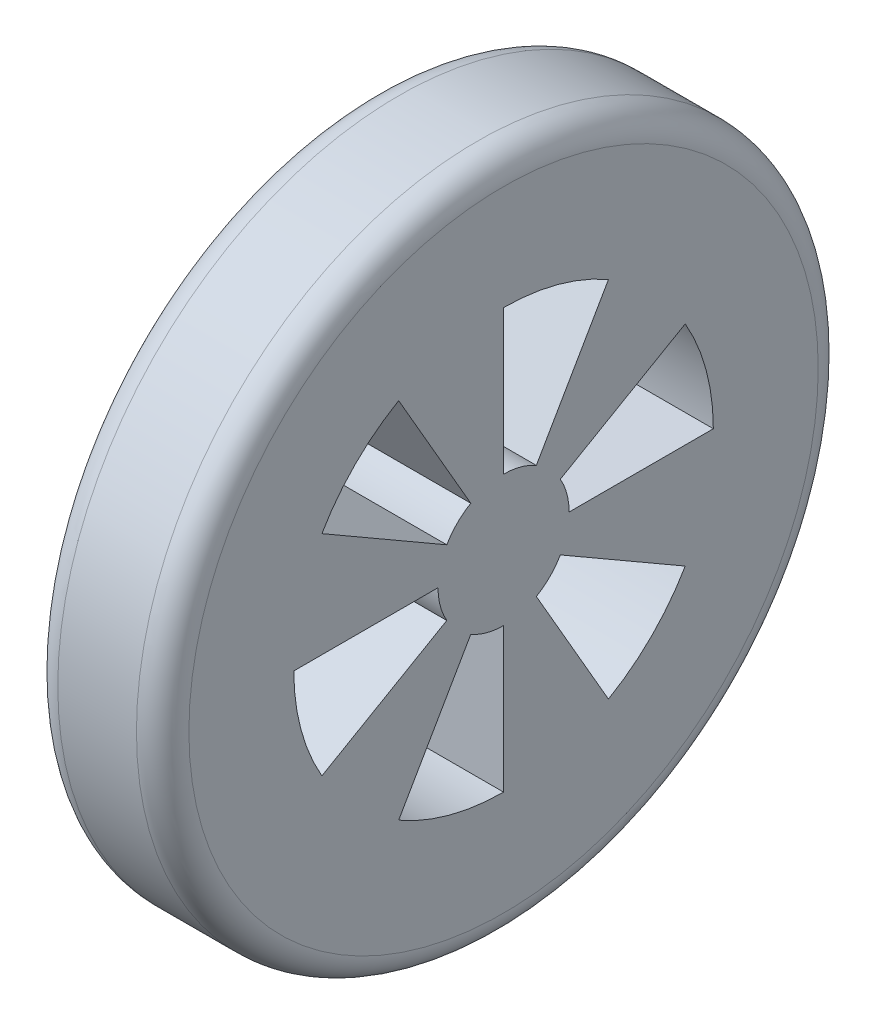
from build123d import *

# Parameters (mm, degrees)
EXTRUDE_2_DEPTH      = 25
EXTRUDE_2_DEPTH_BACK = 25
SKETCH_1_R           = 130
SKETCH_1_R_2         = 80
SKETCH_1_R_3         = 25
FILLET_1_R           = 10


with BuildPart() as part:
    # Sketch 1 → Extrude 2 (new, two sides: drawn at the far end of the back side and taken through both)
    # profile 1 of 8: a face of its own
    with BuildSketch(Plane(origin=(0, 0, 0), x_dir=(0, 0, -1), z_dir=(1, 0, 0)).offset(-EXTRUDE_2_DEPTH_BACK)):
        Circle(SKETCH_1_R)
        Circle(SKETCH_1_R_2, mode=Mode.SUBTRACT)
    # profile 2 of 8: a face of its own
    with BuildSketch(Plane(origin=(0, 0, 0), x_dir=(0, 0, -1), z_dir=(1, 0, 0)).offset(-EXTRUDE_2_DEPTH_BACK)):
        with BuildLine():
            Line((-21.650635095, 12.5), (-69.282032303, 40))
            ThreePointArc((-69.282032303, 40), (-77.274066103, 20.705523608), (-80, 0))
            Line((-80, 0), (-25, 0))
            ThreePointArc((-25, 0), (-24.148145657, 6.470476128), (-21.650635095, 12.5))
        make_face()
    # profile 3 of 8: a face of its own
    with BuildSketch(Plane(origin=(0, 0, 0), x_dir=(0, 0, -1), z_dir=(1, 0, 0)).offset(-EXTRUDE_2_DEPTH_BACK)):
        with BuildLine():
            Line((-21.650635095, -12.5), (-69.282032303, -40))
            ThreePointArc((-69.282032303, -40), (-56.568542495, -56.568542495), (-40, -69.282032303))
            Line((-40, -69.282032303), (-12.5, -21.650635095))
            ThreePointArc((-12.5, -21.650635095), (-17.67766953, -17.67766953), (-21.650635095, -12.5))
        make_face()
    # profile 4 of 8: a face of its own
    with BuildSketch(Plane(origin=(0, 0, 0), x_dir=(0, 0, -1), z_dir=(1, 0, 0)).offset(-EXTRUDE_2_DEPTH_BACK)):
        with BuildLine():
            ThreePointArc((0, -80), (20.705523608, -77.274066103), (40, -69.282032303))
            Line((40, -69.282032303), (12.5, -21.650635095))
            ThreePointArc((12.5, -21.650635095), (6.470476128, -24.148145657), (0, -25))
            Line((0, -25), (0, -80))
        make_face()
    # profile 5 of 8: a face of its own
    with BuildSketch(Plane(origin=(0, 0, 0), x_dir=(0, 0, -1), z_dir=(1, 0, 0)).offset(-EXTRUDE_2_DEPTH_BACK)):
        with BuildLine():
            ThreePointArc((69.282032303, -40), (77.274066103, -20.705523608), (80, 0))
            Line((80, 0), (25, 0))
            ThreePointArc((25, 0), (24.148145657, -6.470476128), (21.650635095, -12.5))
            Line((21.650635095, -12.5), (69.282032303, -40))
        make_face()
    # profile 6 of 8: a face of its own
    with BuildSketch(Plane(origin=(0, 0, 0), x_dir=(0, 0, -1), z_dir=(1, 0, 0)).offset(-EXTRUDE_2_DEPTH_BACK)):
        with BuildLine():
            ThreePointArc((69.282032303, 40), (56.568542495, 56.568542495), (40, 69.282032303))
            Line((40, 69.282032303), (12.5, 21.650635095))
            ThreePointArc((12.5, 21.650635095), (17.67766953, 17.67766953), (21.650635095, 12.5))
            Line((21.650635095, 12.5), (69.282032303, 40))
        make_face()
    # profile 7 of 8: a face of its own
    with BuildSketch(Plane(origin=(0, 0, 0), x_dir=(0, 0, -1), z_dir=(1, 0, 0)).offset(-EXTRUDE_2_DEPTH_BACK)):
        with BuildLine():
            Line((0, 25), (0, 80))
            ThreePointArc((0, 80), (-20.705523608, 77.274066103), (-40, 69.282032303))
            Line((-40, 69.282032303), (-12.5, 21.650635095))
            ThreePointArc((-12.5, 21.650635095), (-6.470476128, 24.148145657), (0, 25))
        make_face()
    # profile 8 of 8: a face of its own
    with BuildSketch(Plane(origin=(0, 0, 0), x_dir=(0, 0, -1), z_dir=(1, 0, 0)).offset(-EXTRUDE_2_DEPTH_BACK)):
        Circle(SKETCH_1_R_3)
    extrude(amount=EXTRUDE_2_DEPTH + EXTRUDE_2_DEPTH_BACK)

    # Fillet 1
    fillet_1_edges = [part.edges().sort_by_distance(p)[0] for p in [
        (-25, 0, 130),
        (25, 0, 130),
    ]]
    fillet(fillet_1_edges, radius=FILLET_1_R)


solid = part.part
